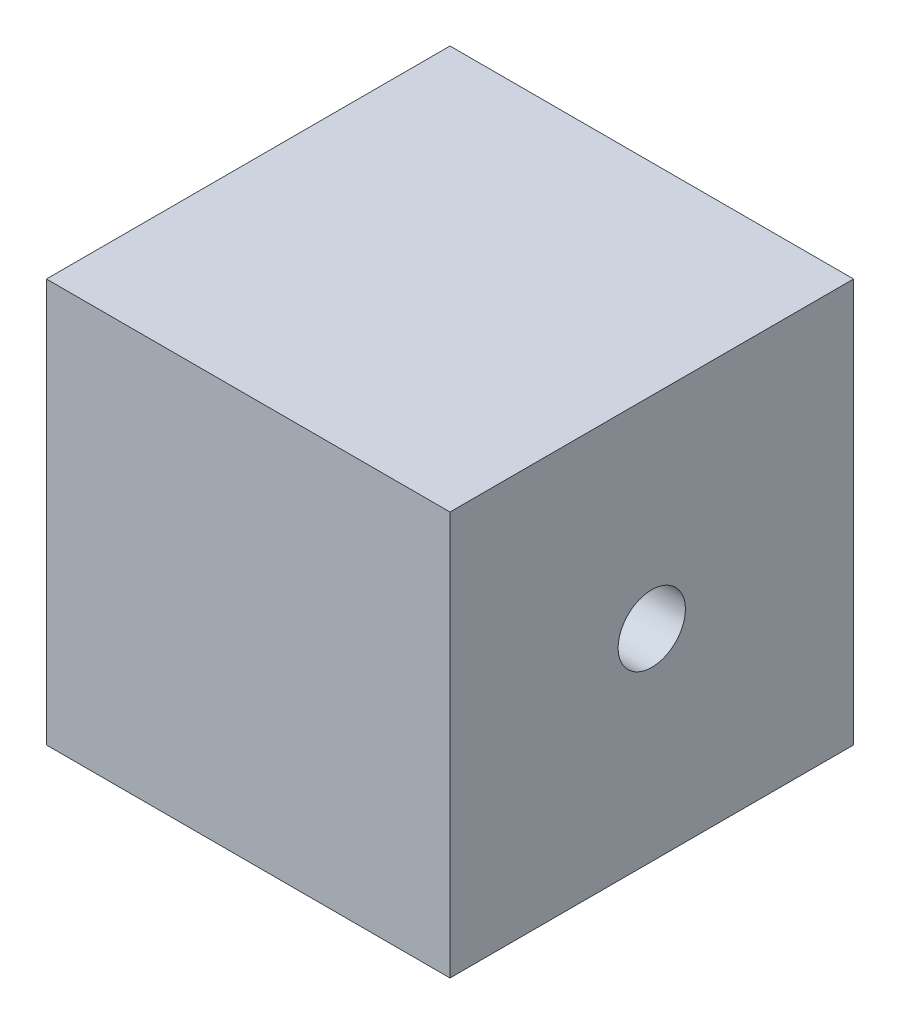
ISO-10303-21;
HEADER;
FILE_DESCRIPTION(('STEP AP214'),'2;1');
FILE_NAME('part.step','',(''),(''),'','','');
FILE_SCHEMA(('AUTOMOTIVE_DESIGN { 1 0 10303 214 1 1 1 1 }'));
ENDSEC;
DATA;
#1=APPLICATION_CONTEXT('core data for automotive mechanical design processes');
#2=APPLICATION_PROTOCOL_DEFINITION('international standard','automotive_design',2000,#1);
#3=PRODUCT_CONTEXT('',#1,'mechanical');
#4=PRODUCT('Part','Part','',(#3));
#5=PRODUCT_RELATED_PRODUCT_CATEGORY('part','',(#4));
#6=PRODUCT_DEFINITION_FORMATION('','',#4);
#7=PRODUCT_DEFINITION_CONTEXT('part definition',#1,'design');
#8=PRODUCT_DEFINITION('design','',#6,#7);
#9=PRODUCT_DEFINITION_SHAPE('','',#8);
#10=(LENGTH_UNIT() NAMED_UNIT(*) SI_UNIT(.MILLI.,.METRE.));
#11=(NAMED_UNIT(*) PLANE_ANGLE_UNIT() SI_UNIT($,.RADIAN.));
#12=(NAMED_UNIT(*) SI_UNIT($,.STERADIAN.) SOLID_ANGLE_UNIT());
#13=UNCERTAINTY_MEASURE_WITH_UNIT(LENGTH_MEASURE(1.E-05),#10,'distance_accuracy_value','');
#14=(GEOMETRIC_REPRESENTATION_CONTEXT(3) GLOBAL_UNCERTAINTY_ASSIGNED_CONTEXT((#13)) GLOBAL_UNIT_ASSIGNED_CONTEXT((#10,
#11,#12)) REPRESENTATION_CONTEXT('',''));
#15=CARTESIAN_POINT('',(0.,0.,0.));
#16=DIRECTION('',(0.,0.,1.));
#17=DIRECTION('',(1.,0.,0.));
#18=AXIS2_PLACEMENT_3D('',#15,#16,#17);
#19=CARTESIAN_POINT('',(-76.2,76.2,76.2));
#20=DIRECTION('',(1.,0.,0.));
#21=DIRECTION('',(0.,0.,-1.));
#22=AXIS2_PLACEMENT_3D('',#19,#20,#21);
#23=PLANE('',#22);
#24=DIRECTION('',(0.,-1.,0.));
#25=VECTOR('',#24,1.);
#26=CARTESIAN_POINT('',(-76.2,76.2,-76.2));
#27=LINE('',#26,#25);
#28=CARTESIAN_POINT('',(-76.2,76.2,-76.2));
#29=VERTEX_POINT('',#28);
#30=CARTESIAN_POINT('',(-76.2,-76.2,-76.2));
#31=VERTEX_POINT('',#30);
#32=EDGE_CURVE('E98',#29,#31,#27,.T.);
#33=ORIENTED_EDGE('',*,*,#32,.T.);
#34=DIRECTION('',(0.,0.,-1.));
#35=VECTOR('',#34,1.);
#36=CARTESIAN_POINT('',(-76.2,-76.2,76.2));
#37=LINE('',#36,#35);
#38=CARTESIAN_POINT('',(-76.2,-76.2,76.2));
#39=VERTEX_POINT('',#38);
#40=EDGE_CURVE('E11',#39,#31,#37,.T.);
#41=ORIENTED_EDGE('',*,*,#40,.F.);
#42=DIRECTION('',(0.,-1.,0.));
#43=VECTOR('',#42,1.);
#44=CARTESIAN_POINT('',(-76.2,76.2,76.2));
#45=LINE('',#44,#43);
#46=CARTESIAN_POINT('',(-76.2,76.2,76.2));
#47=VERTEX_POINT('',#46);
#48=EDGE_CURVE('E86',#47,#39,#45,.T.);
#49=ORIENTED_EDGE('',*,*,#48,.F.);
#50=DIRECTION('',(0.,0.,-1.));
#51=VECTOR('',#50,1.);
#52=CARTESIAN_POINT('',(-76.2,76.2,76.2));
#53=LINE('',#52,#51);
#54=EDGE_CURVE('E94',#47,#29,#53,.T.);
#55=ORIENTED_EDGE('',*,*,#54,.T.);
#56=EDGE_LOOP('',(#33,#41,#49,#55));
#57=FACE_BOUND('',#56,.T.);
#58=ADVANCED_FACE('F35',(#57),#23,.F.);
#59=CARTESIAN_POINT('',(-76.2,-76.2,76.2));
#60=DIRECTION('',(0.,1.,0.));
#61=DIRECTION('',(0.,0.,1.));
#62=AXIS2_PLACEMENT_3D('',#59,#60,#61);
#63=PLANE('',#62);
#64=DIRECTION('',(1.,0.,0.));
#65=VECTOR('',#64,1.);
#66=CARTESIAN_POINT('',(-76.2,-76.2,-76.2));
#67=LINE('',#66,#65);
#68=CARTESIAN_POINT('',(76.2,-76.2,-76.2));
#69=VERTEX_POINT('',#68);
#70=EDGE_CURVE('E90',#31,#69,#67,.T.);
#71=ORIENTED_EDGE('',*,*,#70,.T.);
#72=DIRECTION('',(0.,0.,-1.));
#73=VECTOR('',#72,1.);
#74=CARTESIAN_POINT('',(76.2,-76.2,76.2));
#75=LINE('',#74,#73);
#76=CARTESIAN_POINT('',(76.2,-76.2,76.2));
#77=VERTEX_POINT('',#76);
#78=EDGE_CURVE('E43',#77,#69,#75,.T.);
#79=ORIENTED_EDGE('',*,*,#78,.F.);
#80=DIRECTION('',(1.,0.,0.));
#81=VECTOR('',#80,1.);
#82=CARTESIAN_POINT('',(-76.2,-76.2,76.2));
#83=LINE('',#82,#81);
#84=EDGE_CURVE('E81',#39,#77,#83,.T.);
#85=ORIENTED_EDGE('',*,*,#84,.F.);
#86=ORIENTED_EDGE('',*,*,#40,.T.);
#87=EDGE_LOOP('',(#71,#79,#85,#86));
#88=FACE_BOUND('',#87,.T.);
#89=ADVANCED_FACE('F89',(#88),#63,.F.);
#90=CARTESIAN_POINT('',(76.2,76.2,76.2));
#91=DIRECTION('',(-1.,0.,0.));
#92=DIRECTION('',(0.,0.,1.));
#93=AXIS2_PLACEMENT_3D('',#90,#91,#92);
#94=PLANE('',#93);
#95=CARTESIAN_POINT('',(76.2,0.,0.));
#96=DIRECTION('',(1.,0.,0.));
#97=DIRECTION('',(0.,0.,-1.));
#98=AXIS2_PLACEMENT_3D('',#95,#96,#97);
#99=CIRCLE('',#98,12.7);
#100=CARTESIAN_POINT('',(76.2,0.,-12.7));
#101=VERTEX_POINT('',#100);
#102=EDGE_CURVE('E112',#101,#101,#99,.T.);
#103=ORIENTED_EDGE('',*,*,#102,.F.);
#104=EDGE_LOOP('',(#103));
#105=FACE_BOUND('',#104,.T.);
#106=DIRECTION('',(0.,1.,0.));
#107=VECTOR('',#106,1.);
#108=CARTESIAN_POINT('',(76.2,76.2,-76.2));
#109=LINE('',#108,#107);
#110=CARTESIAN_POINT('',(76.2,76.2,-76.2));
#111=VERTEX_POINT('',#110);
#112=EDGE_CURVE('E68',#69,#111,#109,.T.);
#113=ORIENTED_EDGE('',*,*,#112,.T.);
#114=DIRECTION('',(0.,0.,-1.));
#115=VECTOR('',#114,1.);
#116=CARTESIAN_POINT('',(76.2,76.2,76.2));
#117=LINE('',#116,#115);
#118=CARTESIAN_POINT('',(76.2,76.2,76.2));
#119=VERTEX_POINT('',#118);
#120=EDGE_CURVE('E91',#119,#111,#117,.T.);
#121=ORIENTED_EDGE('',*,*,#120,.F.);
#122=DIRECTION('',(0.,1.,0.));
#123=VECTOR('',#122,1.);
#124=CARTESIAN_POINT('',(76.2,76.2,76.2));
#125=LINE('',#124,#123);
#126=EDGE_CURVE('E84',#77,#119,#125,.T.);
#127=ORIENTED_EDGE('',*,*,#126,.F.);
#128=ORIENTED_EDGE('',*,*,#78,.T.);
#129=EDGE_LOOP('',(#113,#121,#127,#128));
#130=FACE_BOUND('',#129,.T.);
#131=ADVANCED_FACE('F92',(#105,#130),#94,.F.);
#132=CARTESIAN_POINT('',(-76.2,76.2,76.2));
#133=DIRECTION('',(0.,-1.,0.));
#134=DIRECTION('',(0.,0.,-1.));
#135=AXIS2_PLACEMENT_3D('',#132,#133,#134);
#136=PLANE('',#135);
#137=DIRECTION('',(-1.,0.,0.));
#138=VECTOR('',#137,1.);
#139=CARTESIAN_POINT('',(-76.2,76.2,-76.2));
#140=LINE('',#139,#138);
#141=EDGE_CURVE('E74',#111,#29,#140,.T.);
#142=ORIENTED_EDGE('',*,*,#141,.T.);
#143=ORIENTED_EDGE('',*,*,#54,.F.);
#144=DIRECTION('',(-1.,0.,0.));
#145=VECTOR('',#144,1.);
#146=CARTESIAN_POINT('',(-76.2,76.2,76.2));
#147=LINE('',#146,#145);
#148=EDGE_CURVE('E51',#119,#47,#147,.T.);
#149=ORIENTED_EDGE('',*,*,#148,.F.);
#150=ORIENTED_EDGE('',*,*,#120,.T.);
#151=EDGE_LOOP('',(#142,#143,#149,#150));
#152=FACE_BOUND('',#151,.T.);
#153=ADVANCED_FACE('F106',(#152),#136,.F.);
#154=CARTESIAN_POINT('',(0.,0.,76.2));
#155=DIRECTION('',(0.,0.,1.));
#156=DIRECTION('',(1.,0.,0.));
#157=AXIS2_PLACEMENT_3D('',#154,#155,#156);
#158=PLANE('',#157);
#159=ORIENTED_EDGE('',*,*,#48,.T.);
#160=ORIENTED_EDGE('',*,*,#84,.T.);
#161=ORIENTED_EDGE('',*,*,#126,.T.);
#162=ORIENTED_EDGE('',*,*,#148,.T.);
#163=EDGE_LOOP('',(#159,#160,#161,#162));
#164=FACE_BOUND('',#163,.T.);
#165=ADVANCED_FACE('F82',(#164),#158,.T.);
#166=CARTESIAN_POINT('',(0.,0.,-76.2));
#167=DIRECTION('',(0.,0.,1.));
#168=DIRECTION('',(1.,0.,0.));
#169=AXIS2_PLACEMENT_3D('',#166,#167,#168);
#170=PLANE('',#169);
#171=ORIENTED_EDGE('',*,*,#32,.F.);
#172=ORIENTED_EDGE('',*,*,#141,.F.);
#173=ORIENTED_EDGE('',*,*,#112,.F.);
#174=ORIENTED_EDGE('',*,*,#70,.F.);
#175=EDGE_LOOP('',(#171,#172,#173,#174));
#176=FACE_BOUND('',#175,.T.);
#177=ADVANCED_FACE('F109',(#176),#170,.F.);
#178=CARTESIAN_POINT('',(0.,0.,0.));
#179=DIRECTION('',(1.,0.,0.));
#180=DIRECTION('',(0.,0.,-1.));
#181=AXIS2_PLACEMENT_3D('',#178,#179,#180);
#182=CYLINDRICAL_SURFACE('',#181,12.7);
#183=CARTESIAN_POINT('',(0.,0.,0.));
#184=DIRECTION('',(1.,0.,0.));
#185=DIRECTION('',(0.,0.,-1.));
#186=AXIS2_PLACEMENT_3D('',#183,#184,#185);
#187=CIRCLE('',#186,12.7);
#188=CARTESIAN_POINT('',(0.,0.,-12.7));
#189=VERTEX_POINT('',#188);
#190=EDGE_CURVE('E101',#189,#189,#187,.T.);
#191=CARTESIAN_POINT('',(0.,0.,-12.7));
#192=CARTESIAN_POINT('',(0.793750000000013,0.,-12.7));
#193=CARTESIAN_POINT('',(1.58750000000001,0.,-12.7));
#194=CARTESIAN_POINT('',(3.17500000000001,0.,-12.7));
#195=CARTESIAN_POINT('',(3.96875000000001,0.,-12.7));
#196=CARTESIAN_POINT('',(5.55625000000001,0.,-12.7));
#197=CARTESIAN_POINT('',(6.35000000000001,0.,-12.7));
#198=CARTESIAN_POINT('',(7.93750000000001,0.,-12.7));
#199=CARTESIAN_POINT('',(8.73125000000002,0.,-12.7));
#200=CARTESIAN_POINT('',(10.31875,0.,-12.7));
#201=CARTESIAN_POINT('',(11.1125,0.,-12.7));
#202=CARTESIAN_POINT('',(12.7,0.,-12.7));
#203=CARTESIAN_POINT('',(13.49375,0.,-12.7));
#204=CARTESIAN_POINT('',(15.08125,0.,-12.7));
#205=CARTESIAN_POINT('',(15.875,0.,-12.7));
#206=CARTESIAN_POINT('',(17.4625,0.,-12.7));
#207=CARTESIAN_POINT('',(18.25625,0.,-12.7));
#208=CARTESIAN_POINT('',(19.84375,0.,-12.7));
#209=CARTESIAN_POINT('',(20.6375,0.,-12.7));
#210=CARTESIAN_POINT('',(22.225,0.,-12.7));
#211=CARTESIAN_POINT('',(23.01875,0.,-12.7));
#212=CARTESIAN_POINT('',(24.60625,0.,-12.7));
#213=CARTESIAN_POINT('',(25.4,0.,-12.7));
#214=CARTESIAN_POINT('',(26.9875,0.,-12.7));
#215=CARTESIAN_POINT('',(27.78125,0.,-12.7));
#216=CARTESIAN_POINT('',(29.36875,0.,-12.7));
#217=CARTESIAN_POINT('',(30.1625,0.,-12.7));
#218=CARTESIAN_POINT('',(31.75,0.,-12.7));
#219=CARTESIAN_POINT('',(32.54375,0.,-12.7));
#220=CARTESIAN_POINT('',(34.13125,0.,-12.7));
#221=CARTESIAN_POINT('',(34.925,0.,-12.7));
#222=CARTESIAN_POINT('',(36.5125,0.,-12.7));
#223=CARTESIAN_POINT('',(37.30625,0.,-12.7));
#224=CARTESIAN_POINT('',(38.89375,0.,-12.7));
#225=CARTESIAN_POINT('',(39.6875,0.,-12.7));
#226=CARTESIAN_POINT('',(41.275,0.,-12.7));
#227=CARTESIAN_POINT('',(42.06875,0.,-12.7));
#228=CARTESIAN_POINT('',(43.65625,0.,-12.7));
#229=CARTESIAN_POINT('',(44.45,0.,-12.7));
#230=CARTESIAN_POINT('',(46.0375,0.,-12.7));
#231=CARTESIAN_POINT('',(46.83125,0.,-12.7));
#232=CARTESIAN_POINT('',(48.41875,0.,-12.7));
#233=CARTESIAN_POINT('',(49.2125,0.,-12.7));
#234=CARTESIAN_POINT('',(50.8,0.,-12.7));
#235=CARTESIAN_POINT('',(51.59375,0.,-12.7));
#236=CARTESIAN_POINT('',(53.18125,0.,-12.7));
#237=CARTESIAN_POINT('',(53.975,0.,-12.7));
#238=CARTESIAN_POINT('',(55.5625,0.,-12.7));
#239=CARTESIAN_POINT('',(56.35625,0.,-12.7));
#240=CARTESIAN_POINT('',(57.94375,0.,-12.7));
#241=CARTESIAN_POINT('',(58.7375,0.,-12.7));
#242=CARTESIAN_POINT('',(60.325,0.,-12.7));
#243=CARTESIAN_POINT('',(61.11875,0.,-12.7));
#244=CARTESIAN_POINT('',(62.70625,0.,-12.7));
#245=CARTESIAN_POINT('',(63.5,0.,-12.7));
#246=CARTESIAN_POINT('',(65.0875,0.,-12.7));
#247=CARTESIAN_POINT('',(65.88125,0.,-12.7));
#248=CARTESIAN_POINT('',(67.46875,0.,-12.7));
#249=CARTESIAN_POINT('',(68.2625,0.,-12.7));
#250=CARTESIAN_POINT('',(69.85,0.,-12.7));
#251=CARTESIAN_POINT('',(70.64375,0.,-12.7));
#252=CARTESIAN_POINT('',(72.23125,0.,-12.7));
#253=CARTESIAN_POINT('',(73.025,0.,-12.7));
#254=CARTESIAN_POINT('',(74.6125,0.,-12.7));
#255=CARTESIAN_POINT('',(75.40625,0.,-12.7));
#256=CARTESIAN_POINT('',(76.2,0.,-12.7));
#257=B_SPLINE_CURVE_WITH_KNOTS('',3,(#191,#192,#193,#194,#195,#196,#197,#198,#199,#200,#201,
#202,#203,#204,#205,#206,#207,#208,#209,#210,#211,#212,#213,#214,#215,#216,#217,#218,#219,#220,
#221,#222,#223,#224,#225,#226,#227,#228,#229,#230,#231,#232,#233,#234,#235,#236,#237,#238,#239,
#240,#241,#242,#243,#244,#245,#246,#247,#248,#249,#250,#251,#252,#253,#254,#255,#256),
.UNSPECIFIED.,.F.,.F.,(4,2,2,2,2,2,2,2,2,2,2,2,2,2,2,2,2,2,2,2,2,2,2,2,2,2,2,2,2,2,2,2,4),(0.,
2.38125,4.7625,7.14375,9.525,11.90625,14.2875,16.66875,19.05,21.43125,23.8125,26.19375,28.575,
30.95625,33.3375,35.71875,38.1,40.48125,42.8625,45.24375,47.625,50.00625,52.3875,54.76875,57.15,
59.53125,61.9125,64.29375,66.675,69.05625,71.4375,73.81875,76.2),.UNSPECIFIED.);
#258=EDGE_CURVE('BSEAM120',#189,#101,#257,.T.);
#259=ORIENTED_EDGE('',*,*,#190,.F.);
#260=ORIENTED_EDGE('',*,*,#102,.T.);
#261=ORIENTED_EDGE('',*,*,#258,.T.);
#262=ORIENTED_EDGE('',*,*,#258,.F.);
#263=EDGE_LOOP('',(#259,#261,#260,#262));
#264=FACE_BOUND('',#263,.T.);
#265=ADVANCED_FACE('F120',(#264),#182,.F.);
#266=CARTESIAN_POINT('',(0.,0.,0.));
#267=DIRECTION('',(1.,0.,0.));
#268=DIRECTION('',(0.,0.,-1.));
#269=AXIS2_PLACEMENT_3D('',#266,#267,#268);
#270=PLANE('',#269);
#271=ORIENTED_EDGE('',*,*,#190,.T.);
#272=EDGE_LOOP('',(#271));
#273=FACE_BOUND('',#272,.T.);
#274=ADVANCED_FACE('F118',(#273),#270,.T.);
#275=CLOSED_SHELL('',(#58,#89,#131,#153,#165,#177,#265,#274));
#276=MANIFOLD_SOLID_BREP('B2',#275);
#277=ADVANCED_BREP_SHAPE_REPRESENTATION('',(#18,#276),#14);
#278=SHAPE_DEFINITION_REPRESENTATION(#9,#277);
ENDSEC;
END-ISO-10303-21;
